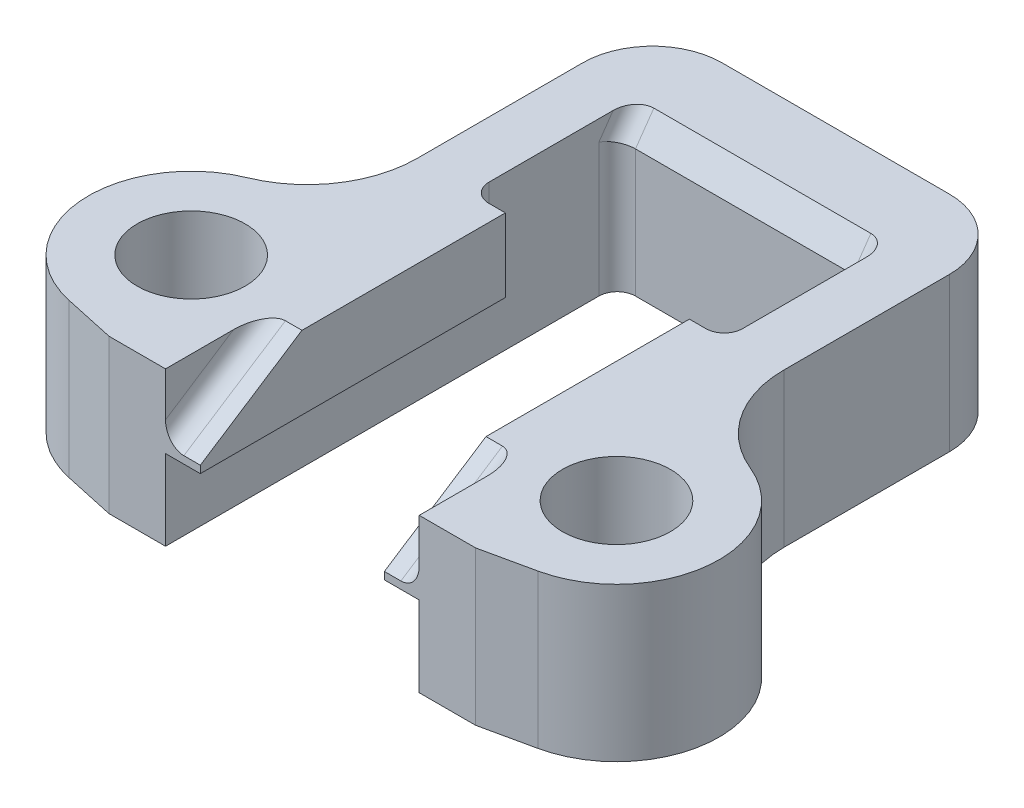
ISO-10303-21;
HEADER;
FILE_DESCRIPTION(('STEP AP214'),'2;1');
FILE_NAME('part.step','',(''),(''),'','','');
FILE_SCHEMA(('AUTOMOTIVE_DESIGN { 1 0 10303 214 1 1 1 1 }'));
ENDSEC;
DATA;
#1=APPLICATION_CONTEXT('core data for automotive mechanical design processes');
#2=APPLICATION_PROTOCOL_DEFINITION('international standard','automotive_design',2000,#1);
#3=PRODUCT_CONTEXT('',#1,'mechanical');
#4=PRODUCT('Part','Part','',(#3));
#5=PRODUCT_RELATED_PRODUCT_CATEGORY('part','',(#4));
#6=PRODUCT_DEFINITION_FORMATION('','',#4);
#7=PRODUCT_DEFINITION_CONTEXT('part definition',#1,'design');
#8=PRODUCT_DEFINITION('design','',#6,#7);
#9=PRODUCT_DEFINITION_SHAPE('','',#8);
#10=(LENGTH_UNIT() NAMED_UNIT(*) SI_UNIT(.MILLI.,.METRE.));
#11=(NAMED_UNIT(*) PLANE_ANGLE_UNIT() SI_UNIT($,.RADIAN.));
#12=(NAMED_UNIT(*) SI_UNIT($,.STERADIAN.) SOLID_ANGLE_UNIT());
#13=UNCERTAINTY_MEASURE_WITH_UNIT(LENGTH_MEASURE(1.E-05),#10,'distance_accuracy_value','');
#14=(GEOMETRIC_REPRESENTATION_CONTEXT(3) GLOBAL_UNCERTAINTY_ASSIGNED_CONTEXT((#13)) GLOBAL_UNIT_ASSIGNED_CONTEXT((#10,
#11,#12)) REPRESENTATION_CONTEXT('',''));
#15=CARTESIAN_POINT('',(0.,0.,0.));
#16=DIRECTION('',(0.,0.,1.));
#17=DIRECTION('',(1.,0.,0.));
#18=AXIS2_PLACEMENT_3D('',#15,#16,#17);
#19=CARTESIAN_POINT('',(-38.74,-7.13469398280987,0.960000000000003));
#20=DIRECTION('',(-1.,0.,0.));
#21=DIRECTION('',(0.,0.,1.));
#22=AXIS2_PLACEMENT_3D('',#19,#20,#21);
#23=PLANE('',#22);
#24=DIRECTION('',(0.,0.,1.));
#25=VECTOR('',#24,1.);
#26=CARTESIAN_POINT('',(-38.74,14.391,0.960000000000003));
#27=LINE('',#26,#25);
#28=CARTESIAN_POINT('',(-38.74,14.391,-11.2496127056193));
#29=VERTEX_POINT('',#28);
#30=CARTESIAN_POINT('',(-38.74,14.391,-7.86));
#31=VERTEX_POINT('',#30);
#32=EDGE_CURVE('E452',#29,#31,#27,.T.);
#33=ORIENTED_EDGE('',*,*,#32,.F.);
#34=DIRECTION('',(0.,-0.819152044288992,0.573576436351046));
#35=VECTOR('',#34,1.);
#36=CARTESIAN_POINT('',(-38.74,13.9637142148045,-10.9504239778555));
#37=LINE('',#36,#35);
#38=CARTESIAN_POINT('',(-38.74,13.8345753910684,-10.86));
#39=VERTEX_POINT('',#38);
#40=EDGE_CURVE('E511',#29,#39,#37,.T.);
#41=ORIENTED_EDGE('',*,*,#40,.T.);
#42=DIRECTION('',(0.,1.,0.));
#43=VECTOR('',#42,1.);
#44=CARTESIAN_POINT('',(-38.74,10.2,-10.86));
#45=LINE('',#44,#43);
#46=CARTESIAN_POINT('',(-38.74,10.2,-10.86));
#47=VERTEX_POINT('',#46);
#48=EDGE_CURVE('E509',#39,#47,#45,.F.);
#49=ORIENTED_EDGE('',*,*,#48,.T.);
#50=DIRECTION('',(0.,0.,-1.));
#51=VECTOR('',#50,1.);
#52=CARTESIAN_POINT('',(-38.74,10.2,0.960000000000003));
#53=LINE('',#52,#51);
#54=CARTESIAN_POINT('',(-38.74,10.2,0.960000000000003));
#55=VERTEX_POINT('',#54);
#56=EDGE_CURVE('E465',#55,#47,#53,.T.);
#57=ORIENTED_EDGE('',*,*,#56,.F.);
#58=DIRECTION('',(0.,1.,0.));
#59=VECTOR('',#58,1.);
#60=CARTESIAN_POINT('',(-38.74,-7.13469398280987,0.960000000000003));
#61=LINE('',#60,#59);
#62=CARTESIAN_POINT('',(-38.74,12.391,0.960000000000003));
#63=VERTEX_POINT('',#62);
#64=EDGE_CURVE('E458',#55,#63,#61,.T.);
#65=ORIENTED_EDGE('',*,*,#64,.T.);
#66=DIRECTION('',(0.,0.,1.));
#67=VECTOR('',#66,1.);
#68=CARTESIAN_POINT('',(-38.74,12.391,-7.36));
#69=LINE('',#68,#67);
#70=CARTESIAN_POINT('',(-38.74,12.391,-7.86));
#71=VERTEX_POINT('',#70);
#72=EDGE_CURVE('E410',#71,#63,#69,.T.);
#73=ORIENTED_EDGE('',*,*,#72,.F.);
#74=DIRECTION('',(0.,-1.,0.));
#75=VECTOR('',#74,1.);
#76=CARTESIAN_POINT('',(-38.74,-7.13469398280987,-7.86));
#77=LINE('',#76,#75);
#78=EDGE_CURVE('E507',#71,#31,#77,.F.);
#79=ORIENTED_EDGE('',*,*,#78,.T.);
#80=EDGE_LOOP('',(#33,#41,#49,#57,#65,#73,#79));
#81=FACE_BOUND('',#80,.T.);
#82=ADVANCED_FACE('F38',(#81),#23,.T.);
#83=CARTESIAN_POINT('',(-38.74,14.391,-0.893717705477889));
#84=VERTEX_POINT('',#83);
#85=CARTESIAN_POINT('',(-38.74,14.391,0.960000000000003));
#86=VERTEX_POINT('',#85);
#87=EDGE_CURVE('E451',#84,#86,#27,.T.);
#88=ORIENTED_EDGE('',*,*,#87,.F.);
#89=DIRECTION('',(0.,0.544639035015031,-0.838670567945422));
#90=VECTOR('',#89,1.);
#91=CARTESIAN_POINT('',(-38.74,7.159069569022,10.2424785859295));
#92=LINE('',#91,#90);
#93=CARTESIAN_POINT('',(-38.74,13.187181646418,0.960000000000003));
#94=VERTEX_POINT('',#93);
#95=EDGE_CURVE('E505',#84,#94,#92,.F.);
#96=ORIENTED_EDGE('',*,*,#95,.T.);
#97=EDGE_CURVE('E473',#94,#86,#61,.T.);
#98=ORIENTED_EDGE('',*,*,#97,.T.);
#99=EDGE_LOOP('',(#88,#96,#98));
#100=FACE_BOUND('',#99,.T.);
#101=ADVANCED_FACE('F648',(#100),#23,.T.);
#102=CARTESIAN_POINT('',(-37.2,-7.13469398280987,0.960000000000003));
#103=DIRECTION('',(0.,0.,1.));
#104=DIRECTION('',(1.,0.,0.));
#105=AXIS2_PLACEMENT_3D('',#102,#103,#104);
#106=PLANE('',#105);
#107=DIRECTION('',(-1.,0.,0.));
#108=VECTOR('',#107,1.);
#109=CARTESIAN_POINT('',(-37.2,10.2,0.960000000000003));
#110=LINE('',#109,#108);
#111=CARTESIAN_POINT('',(-37.2,10.2,0.960000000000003));
#112=VERTEX_POINT('',#111);
#113=EDGE_CURVE('E468',#112,#55,#110,.T.);
#114=ORIENTED_EDGE('',*,*,#113,.F.);
#115=DIRECTION('',(0.,1.,0.));
#116=VECTOR('',#115,1.);
#117=CARTESIAN_POINT('',(-37.2,-7.13469398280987,0.960000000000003));
#118=LINE('',#117,#116);
#119=CARTESIAN_POINT('',(-37.2,14.391,0.960000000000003));
#120=VERTEX_POINT('',#119);
#121=EDGE_CURVE('E454',#112,#120,#118,.T.);
#122=ORIENTED_EDGE('',*,*,#121,.T.);
#123=DIRECTION('',(1.,0.,0.));
#124=VECTOR('',#123,1.);
#125=CARTESIAN_POINT('',(-37.2,14.391,0.960000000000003));
#126=LINE('',#125,#124);
#127=EDGE_CURVE('E437',#86,#120,#126,.T.);
#128=ORIENTED_EDGE('',*,*,#127,.F.);
#129=ORIENTED_EDGE('',*,*,#97,.F.);
#130=CARTESIAN_POINT('',(-39.24,13.187181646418,0.960000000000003));
#131=DIRECTION('',(0.,0.,1.));
#132=DIRECTION('',(0.,1.,0.));
#133=AXIS2_PLACEMENT_3D('',#130,#131,#132);
#134=ELLIPSE('',#133,0.596181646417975,0.5);
#135=CARTESIAN_POINT('',(-39.24,12.591,0.960000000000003));
#136=VERTEX_POINT('',#135);
#137=EDGE_CURVE('E522',#94,#136,#134,.F.);
#138=ORIENTED_EDGE('',*,*,#137,.T.);
#139=DIRECTION('',(1.,0.,0.));
#140=VECTOR('',#139,1.);
#141=CARTESIAN_POINT('',(-39.69,12.591,0.960000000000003));
#142=LINE('',#141,#140);
#143=CARTESIAN_POINT('',(-39.69,12.591,0.960000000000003));
#144=VERTEX_POINT('',#143);
#145=EDGE_CURVE('E428',#144,#136,#142,.T.);
#146=ORIENTED_EDGE('',*,*,#145,.F.);
#147=DIRECTION('',(0.,1.,0.));
#148=VECTOR('',#147,1.);
#149=CARTESIAN_POINT('',(-39.69,12.591,0.960000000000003));
#150=LINE('',#149,#148);
#151=CARTESIAN_POINT('',(-39.69,12.391,0.960000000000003));
#152=VERTEX_POINT('',#151);
#153=EDGE_CURVE('E416',#152,#144,#150,.T.);
#154=ORIENTED_EDGE('',*,*,#153,.F.);
#155=DIRECTION('',(1.,0.,0.));
#156=VECTOR('',#155,1.);
#157=CARTESIAN_POINT('',(-39.69,12.391,0.960000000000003));
#158=LINE('',#157,#156);
#159=EDGE_CURVE('E431',#152,#63,#158,.T.);
#160=ORIENTED_EDGE('',*,*,#159,.T.);
#161=ORIENTED_EDGE('',*,*,#64,.F.);
#162=EDGE_LOOP('',(#114,#122,#128,#129,#138,#146,#154,#160,#161));
#163=FACE_BOUND('',#162,.T.);
#164=ADVANCED_FACE('F625',(#163),#106,.T.);
#165=CARTESIAN_POINT('',(-38.74,-7.13469398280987,-11.36));
#166=DIRECTION('',(0.,0.,1.));
#167=DIRECTION('',(1.,0.,0.));
#168=AXIS2_PLACEMENT_3D('',#165,#166,#167);
#169=PLANE('',#168);
#170=DIRECTION('',(-1.,0.,0.));
#171=VECTOR('',#170,1.);
#172=CARTESIAN_POINT('',(-38.74,10.2,-11.36));
#173=LINE('',#172,#171);
#174=CARTESIAN_POINT('',(-39.24,10.2,-11.36));
#175=VERTEX_POINT('',#174);
#176=CARTESIAN_POINT('',(-45.16,10.2,-11.36));
#177=VERTEX_POINT('',#176);
#178=EDGE_CURVE('E463',#175,#177,#173,.T.);
#179=ORIENTED_EDGE('',*,*,#178,.F.);
#180=DIRECTION('',(0.,1.,0.));
#181=VECTOR('',#180,1.);
#182=CARTESIAN_POINT('',(-39.24,13.6769259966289,-11.36));
#183=LINE('',#182,#181);
#184=CARTESIAN_POINT('',(-39.24,13.6769259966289,-11.36));
#185=VERTEX_POINT('',#184);
#186=EDGE_CURVE('E516',#175,#185,#183,.T.);
#187=ORIENTED_EDGE('',*,*,#186,.T.);
#188=DIRECTION('',(-1.,0.,0.));
#189=VECTOR('',#188,1.);
#190=CARTESIAN_POINT('',(-42.2,13.6769259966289,-11.36));
#191=LINE('',#190,#189);
#192=CARTESIAN_POINT('',(-45.16,13.6769259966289,-11.36));
#193=VERTEX_POINT('',#192);
#194=EDGE_CURVE('E481',#185,#193,#191,.T.);
#195=ORIENTED_EDGE('',*,*,#194,.T.);
#196=DIRECTION('',(0.,1.,0.));
#197=VECTOR('',#196,1.);
#198=CARTESIAN_POINT('',(-45.16,13.6769259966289,-11.36));
#199=LINE('',#198,#197);
#200=EDGE_CURVE('E382',#177,#193,#199,.T.);
#201=ORIENTED_EDGE('',*,*,#200,.F.);
#202=EDGE_LOOP('',(#179,#187,#195,#201));
#203=FACE_BOUND('',#202,.T.);
#204=ADVANCED_FACE('F557',(#203),#169,.T.);
#205=CARTESIAN_POINT('',(-42.2,-7.13469398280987,-13.86));
#206=DIRECTION('',(0.,0.,-1.));
#207=DIRECTION('',(-1.,0.,0.));
#208=AXIS2_PLACEMENT_3D('',#205,#206,#207);
#209=PLANE('',#208);
#210=DIRECTION('',(-1.,0.,0.));
#211=VECTOR('',#210,1.);
#212=CARTESIAN_POINT('',(-42.2,14.391,-13.86));
#213=LINE('',#212,#211);
#214=CARTESIAN_POINT('',(-39.1,14.391,-13.86));
#215=VERTEX_POINT('',#214);
#216=CARTESIAN_POINT('',(-45.3,14.391,-13.86));
#217=VERTEX_POINT('',#216);
#218=EDGE_CURVE('E449',#215,#217,#213,.T.);
#219=ORIENTED_EDGE('',*,*,#218,.F.);
#220=DIRECTION('',(0.,1.,0.));
#221=VECTOR('',#220,1.);
#222=CARTESIAN_POINT('',(-39.1,-7.13469398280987,-13.86));
#223=LINE('',#222,#221);
#224=CARTESIAN_POINT('',(-39.1,10.2,-13.86));
#225=VERTEX_POINT('',#224);
#226=EDGE_CURVE('E498',#215,#225,#223,.F.);
#227=ORIENTED_EDGE('',*,*,#226,.T.);
#228=DIRECTION('',(1.,0.,0.));
#229=VECTOR('',#228,1.);
#230=CARTESIAN_POINT('',(-42.2,10.2,-13.86));
#231=LINE('',#230,#229);
#232=CARTESIAN_POINT('',(-45.3,10.2,-13.86));
#233=VERTEX_POINT('',#232);
#234=EDGE_CURVE('E460',#233,#225,#231,.T.);
#235=ORIENTED_EDGE('',*,*,#234,.F.);
#236=DIRECTION('',(0.,1.,0.));
#237=VECTOR('',#236,1.);
#238=CARTESIAN_POINT('',(-45.3,-7.13469398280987,-13.86));
#239=LINE('',#238,#237);
#240=EDGE_CURVE('E360',#217,#233,#239,.F.);
#241=ORIENTED_EDGE('',*,*,#240,.F.);
#242=EDGE_LOOP('',(#219,#227,#235,#241));
#243=FACE_BOUND('',#242,.T.);
#244=ADVANCED_FACE('F600',(#243),#209,.T.);
#245=CARTESIAN_POINT('',(-37.2,-7.13469398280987,-13.86));
#246=DIRECTION('',(1.,0.,0.));
#247=DIRECTION('',(0.,0.,-1.));
#248=AXIS2_PLACEMENT_3D('',#245,#246,#247);
#249=PLANE('',#248);
#250=DIRECTION('',(0.,0.,1.));
#251=VECTOR('',#250,1.);
#252=CARTESIAN_POINT('',(-37.2,10.2,-13.86));
#253=LINE('',#252,#251);
#254=CARTESIAN_POINT('',(-37.2,10.2,-11.96));
#255=VERTEX_POINT('',#254);
#256=CARTESIAN_POINT('',(-37.2,10.2,-7.44669035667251));
#257=VERTEX_POINT('',#256);
#258=EDGE_CURVE('E457',#255,#257,#253,.T.);
#259=ORIENTED_EDGE('',*,*,#258,.F.);
#260=DIRECTION('',(0.,1.,0.));
#261=VECTOR('',#260,1.);
#262=CARTESIAN_POINT('',(-37.2,-7.13469398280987,-11.96));
#263=LINE('',#262,#261);
#264=CARTESIAN_POINT('',(-37.2,14.391,-11.96));
#265=VERTEX_POINT('',#264);
#266=EDGE_CURVE('E493',#255,#265,#263,.T.);
#267=ORIENTED_EDGE('',*,*,#266,.T.);
#268=DIRECTION('',(0.,0.,-1.));
#269=VECTOR('',#268,1.);
#270=CARTESIAN_POINT('',(-37.2,14.391,-13.86));
#271=LINE('',#270,#269);
#272=CARTESIAN_POINT('',(-37.2,14.391,-7.44669035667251));
#273=VERTEX_POINT('',#272);
#274=EDGE_CURVE('E446',#273,#265,#271,.T.);
#275=ORIENTED_EDGE('',*,*,#274,.F.);
#276=DIRECTION('',(0.,-1.,0.));
#277=VECTOR('',#276,1.);
#278=CARTESIAN_POINT('',(-37.2,10.2,-7.44669035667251));
#279=LINE('',#278,#277);
#280=EDGE_CURVE('E486',#273,#257,#279,.T.);
#281=ORIENTED_EDGE('',*,*,#280,.T.);
#282=EDGE_LOOP('',(#259,#267,#275,#281));
#283=FACE_BOUND('',#282,.T.);
#284=ADVANCED_FACE('F607',(#283),#249,.T.);
#285=CARTESIAN_POINT('',(-36.3996896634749,-7.13469398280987,-2.08));
#286=DIRECTION('',(0.,1.,0.));
#287=DIRECTION('',(0.,0.,1.));
#288=AXIS2_PLACEMENT_3D('',#285,#286,#287);
#289=CYLINDRICAL_SURFACE('',#288,2.8);
#290=CARTESIAN_POINT('',(-36.3996896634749,10.2,-2.08));
#291=DIRECTION('',(0.,1.,0.));
#292=DIRECTION('',(0.,0.,1.));
#293=AXIS2_PLACEMENT_3D('',#290,#291,#292);
#294=CIRCLE('',#293,2.8);
#295=CARTESIAN_POINT('',(-35.3377705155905,10.2,-4.67081603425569));
#296=VERTEX_POINT('',#295);
#297=CARTESIAN_POINT('',(-35.8037249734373,10.2,0.655841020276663));
#298=VERTEX_POINT('',#297);
#299=EDGE_CURVE('E455',#296,#298,#294,.F.);
#300=ORIENTED_EDGE('',*,*,#299,.F.);
#301=DIRECTION('',(0.,1.,0.));
#302=VECTOR('',#301,1.);
#303=CARTESIAN_POINT('',(-35.3377705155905,-7.13469398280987,-4.67081603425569));
#304=LINE('',#303,#302);
#305=CARTESIAN_POINT('',(-35.3377705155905,14.391,-4.67081603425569));
#306=VERTEX_POINT('',#305);
#307=EDGE_CURVE('E483',#296,#306,#304,.T.);
#308=ORIENTED_EDGE('',*,*,#307,.T.);
#309=CARTESIAN_POINT('',(-36.3996896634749,14.391,-2.08));
#310=DIRECTION('',(0.,1.,0.));
#311=DIRECTION('',(0.,0.,-1.));
#312=AXIS2_PLACEMENT_3D('',#309,#310,#311);
#313=CIRCLE('',#312,2.8);
#314=CARTESIAN_POINT('',(-35.8037249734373,14.391,0.655841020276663));
#315=VERTEX_POINT('',#314);
#316=EDGE_CURVE('E443',#315,#306,#313,.T.);
#317=ORIENTED_EDGE('',*,*,#316,.F.);
#318=DIRECTION('',(0.,1.,0.));
#319=VECTOR('',#318,1.);
#320=CARTESIAN_POINT('',(-35.8037249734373,-7.13469398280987,0.655841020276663));
#321=LINE('',#320,#319);
#322=EDGE_CURVE('E474',#298,#315,#321,.T.);
#323=ORIENTED_EDGE('',*,*,#322,.F.);
#324=EDGE_LOOP('',(#300,#308,#317,#323));
#325=FACE_BOUND('',#324,.T.);
#326=ADVANCED_FACE('F617',(#325),#289,.T.);
#327=CARTESIAN_POINT('',(-37.2,-7.13469398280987,0.960000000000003));
#328=DIRECTION('',(0.212844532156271,0.,0.977086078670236));
#329=DIRECTION('',(0.977086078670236,0.,-0.212844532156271));
#330=AXIS2_PLACEMENT_3D('',#327,#328,#329);
#331=PLANE('',#330);
#332=DIRECTION('',(-0.977086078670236,0.,0.212844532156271));
#333=VECTOR('',#332,1.);
#334=CARTESIAN_POINT('',(-37.2,10.2,0.960000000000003));
#335=LINE('',#334,#333);
#336=EDGE_CURVE('E470',#298,#112,#335,.T.);
#337=ORIENTED_EDGE('',*,*,#336,.F.);
#338=ORIENTED_EDGE('',*,*,#322,.T.);
#339=DIRECTION('',(0.977086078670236,0.,-0.212844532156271));
#340=VECTOR('',#339,1.);
#341=CARTESIAN_POINT('',(-37.2,14.391,0.960000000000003));
#342=LINE('',#341,#340);
#343=EDGE_CURVE('E440',#120,#315,#342,.T.);
#344=ORIENTED_EDGE('',*,*,#343,.F.);
#345=ORIENTED_EDGE('',*,*,#121,.F.);
#346=EDGE_LOOP('',(#337,#338,#344,#345));
#347=FACE_BOUND('',#346,.T.);
#348=ADVANCED_FACE('F623',(#347),#331,.T.);
#349=CARTESIAN_POINT('',(0.,10.2,0.));
#350=DIRECTION('',(0.,1.,0.));
#351=DIRECTION('',(0.,0.,1.));
#352=AXIS2_PLACEMENT_3D('',#349,#350,#351);
#353=PLANE('',#352);
#354=CARTESIAN_POINT('',(-36.3996896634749,10.2,-2.08));
#355=DIRECTION('',(0.,1.,0.));
#356=DIRECTION('',(0.,0.,1.));
#357=AXIS2_PLACEMENT_3D('',#354,#355,#356);
#358=CIRCLE('',#357,1.4732);
#359=CARTESIAN_POINT('',(-36.3996896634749,10.2,-0.606799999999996));
#360=VERTEX_POINT('',#359);
#361=EDGE_CURVE('E407',#360,#360,#358,.T.);
#362=ORIENTED_EDGE('',*,*,#361,.T.);
#363=EDGE_LOOP('',(#362));
#364=FACE_BOUND('',#363,.T.);
#365=ORIENTED_EDGE('',*,*,#234,.T.);
#366=CARTESIAN_POINT('',(-39.1,10.2,-11.96));
#367=DIRECTION('',(0.,1.,0.));
#368=DIRECTION('',(0.,0.,1.));
#369=AXIS2_PLACEMENT_3D('',#366,#367,#368);
#370=CIRCLE('',#369,1.9);
#371=EDGE_CURVE('E500',#225,#255,#370,.F.);
#372=ORIENTED_EDGE('',*,*,#371,.T.);
#373=ORIENTED_EDGE('',*,*,#258,.T.);
#374=CARTESIAN_POINT('',(-34.2,10.2,-7.44669035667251));
#375=DIRECTION('',(0.,1.,0.));
#376=DIRECTION('',(0.,0.,1.));
#377=AXIS2_PLACEMENT_3D('',#374,#375,#376);
#378=CIRCLE('',#377,3.);
#379=EDGE_CURVE('E491',#257,#296,#378,.T.);
#380=ORIENTED_EDGE('',*,*,#379,.T.);
#381=ORIENTED_EDGE('',*,*,#299,.T.);
#382=ORIENTED_EDGE('',*,*,#336,.T.);
#383=ORIENTED_EDGE('',*,*,#113,.T.);
#384=ORIENTED_EDGE('',*,*,#56,.T.);
#385=CARTESIAN_POINT('',(-39.24,10.2,-10.86));
#386=DIRECTION('',(0.,1.,0.));
#387=DIRECTION('',(0.,0.,1.));
#388=AXIS2_PLACEMENT_3D('',#385,#386,#387);
#389=CIRCLE('',#388,0.5);
#390=EDGE_CURVE('E526',#47,#175,#389,.T.);
#391=ORIENTED_EDGE('',*,*,#390,.T.);
#392=ORIENTED_EDGE('',*,*,#178,.T.);
#393=CARTESIAN_POINT('',(-45.16,10.2,-10.86));
#394=DIRECTION('',(0.,-1.,0.));
#395=DIRECTION('',(0.,0.,1.));
#396=AXIS2_PLACEMENT_3D('',#393,#394,#395);
#397=CIRCLE('',#396,0.5);
#398=CARTESIAN_POINT('',(-45.66,10.2,-10.86));
#399=VERTEX_POINT('',#398);
#400=EDGE_CURVE('E394',#399,#177,#397,.T.);
#401=ORIENTED_EDGE('',*,*,#400,.F.);
#402=DIRECTION('',(0.,0.,-1.));
#403=VECTOR('',#402,1.);
#404=CARTESIAN_POINT('',(-45.66,10.2,0.960000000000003));
#405=LINE('',#404,#403);
#406=CARTESIAN_POINT('',(-45.66,10.2,0.960000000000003));
#407=VERTEX_POINT('',#406);
#408=EDGE_CURVE('E329',#407,#399,#405,.T.);
#409=ORIENTED_EDGE('',*,*,#408,.F.);
#410=DIRECTION('',(1.,0.,0.));
#411=VECTOR('',#410,1.);
#412=CARTESIAN_POINT('',(-47.2,10.2,0.960000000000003));
#413=LINE('',#412,#411);
#414=CARTESIAN_POINT('',(-47.2,10.2,0.960000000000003));
#415=VERTEX_POINT('',#414);
#416=EDGE_CURVE('E332',#415,#407,#413,.T.);
#417=ORIENTED_EDGE('',*,*,#416,.F.);
#418=DIRECTION('',(0.977086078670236,0.,0.212844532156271));
#419=VECTOR('',#418,1.);
#420=CARTESIAN_POINT('',(-47.2,10.2,0.960000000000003));
#421=LINE('',#420,#419);
#422=CARTESIAN_POINT('',(-48.5962750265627,10.2,0.655841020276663));
#423=VERTEX_POINT('',#422);
#424=EDGE_CURVE('E334',#423,#415,#421,.T.);
#425=ORIENTED_EDGE('',*,*,#424,.F.);
#426=CARTESIAN_POINT('',(-48.0003103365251,10.2,-2.08));
#427=DIRECTION('',(0.,-1.,0.));
#428=DIRECTION('',(0.,0.,1.));
#429=AXIS2_PLACEMENT_3D('',#426,#427,#428);
#430=CIRCLE('',#429,2.8);
#431=CARTESIAN_POINT('',(-49.0622294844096,10.2,-4.67081603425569));
#432=VERTEX_POINT('',#431);
#433=EDGE_CURVE('E322',#432,#423,#430,.F.);
#434=ORIENTED_EDGE('',*,*,#433,.F.);
#435=CARTESIAN_POINT('',(-50.2,10.2,-7.44669035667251));
#436=DIRECTION('',(0.,-1.,0.));
#437=DIRECTION('',(0.,0.,1.));
#438=AXIS2_PLACEMENT_3D('',#435,#436,#437);
#439=CIRCLE('',#438,3.);
#440=CARTESIAN_POINT('',(-47.2,10.2,-7.44669035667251));
#441=VERTEX_POINT('',#440);
#442=EDGE_CURVE('E352',#441,#432,#439,.T.);
#443=ORIENTED_EDGE('',*,*,#442,.F.);
#444=DIRECTION('',(0.,0.,1.));
#445=VECTOR('',#444,1.);
#446=CARTESIAN_POINT('',(-47.2,10.2,-13.86));
#447=LINE('',#446,#445);
#448=CARTESIAN_POINT('',(-47.2,10.2,-11.96));
#449=VERTEX_POINT('',#448);
#450=EDGE_CURVE('E325',#449,#441,#447,.T.);
#451=ORIENTED_EDGE('',*,*,#450,.F.);
#452=CARTESIAN_POINT('',(-45.3,10.2,-11.96));
#453=DIRECTION('',(0.,-1.,0.));
#454=DIRECTION('',(0.,0.,1.));
#455=AXIS2_PLACEMENT_3D('',#452,#453,#454);
#456=CIRCLE('',#455,1.9);
#457=EDGE_CURVE('E363',#233,#449,#456,.F.);
#458=ORIENTED_EDGE('',*,*,#457,.F.);
#459=EDGE_LOOP('',(#365,#372,#373,#380,#381,#382,#383,#384,#391,#392,#401,#409,#417,#425,#434,
#443,#451,#458));
#460=FACE_BOUND('',#459,.T.);
#461=CARTESIAN_POINT('',(-48.0003103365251,10.2,-2.08));
#462=DIRECTION('',(0.,-1.,0.));
#463=DIRECTION('',(0.,0.,1.));
#464=AXIS2_PLACEMENT_3D('',#461,#462,#463);
#465=CIRCLE('',#464,1.4732);
#466=CARTESIAN_POINT('',(-48.0003103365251,10.2,-0.606799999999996));
#467=VERTEX_POINT('',#466);
#468=EDGE_CURVE('E289',#467,#467,#465,.T.);
#469=ORIENTED_EDGE('',*,*,#468,.F.);
#470=EDGE_LOOP('',(#469));
#471=FACE_BOUND('',#470,.T.);
#472=ADVANCED_FACE('F549',(#364,#460,#471),#353,.F.);
#473=CARTESIAN_POINT('',(-36.3996896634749,14.391,-2.08));
#474=DIRECTION('',(0.,-1.,0.));
#475=DIRECTION('',(0.,0.,-1.));
#476=AXIS2_PLACEMENT_3D('',#473,#474,#475);
#477=PLANE('',#476);
#478=CARTESIAN_POINT('',(-36.3996896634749,14.391,-2.08));
#479=DIRECTION('',(0.,1.,0.));
#480=DIRECTION('',(0.,0.,1.));
#481=AXIS2_PLACEMENT_3D('',#478,#479,#480);
#482=CIRCLE('',#481,1.4732);
#483=CARTESIAN_POINT('',(-36.3996896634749,14.391,-0.606799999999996));
#484=VERTEX_POINT('',#483);
#485=EDGE_CURVE('E404',#484,#484,#482,.T.);
#486=ORIENTED_EDGE('',*,*,#485,.F.);
#487=EDGE_LOOP('',(#486));
#488=FACE_BOUND('',#487,.T.);
#489=ORIENTED_EDGE('',*,*,#274,.T.);
#490=CARTESIAN_POINT('',(-39.1,14.391,-11.96));
#491=DIRECTION('',(0.,-1.,0.));
#492=DIRECTION('',(0.,0.,-1.));
#493=AXIS2_PLACEMENT_3D('',#490,#491,#492);
#494=CIRCLE('',#493,1.9);
#495=EDGE_CURVE('E496',#265,#215,#494,.F.);
#496=ORIENTED_EDGE('',*,*,#495,.T.);
#497=ORIENTED_EDGE('',*,*,#218,.T.);
#498=CARTESIAN_POINT('',(-45.3,14.391,-11.96));
#499=DIRECTION('',(0.,1.,0.));
#500=DIRECTION('',(0.,0.,-1.));
#501=AXIS2_PLACEMENT_3D('',#498,#499,#500);
#502=CIRCLE('',#501,1.9);
#503=CARTESIAN_POINT('',(-47.2,14.391,-11.96));
#504=VERTEX_POINT('',#503);
#505=EDGE_CURVE('E357',#504,#217,#502,.F.);
#506=ORIENTED_EDGE('',*,*,#505,.F.);
#507=DIRECTION('',(0.,0.,-1.));
#508=VECTOR('',#507,1.);
#509=CARTESIAN_POINT('',(-47.2,14.391,-13.86));
#510=LINE('',#509,#508);
#511=CARTESIAN_POINT('',(-47.2,14.391,-7.44669035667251));
#512=VERTEX_POINT('',#511);
#513=EDGE_CURVE('E314',#512,#504,#510,.T.);
#514=ORIENTED_EDGE('',*,*,#513,.F.);
#515=CARTESIAN_POINT('',(-50.2,14.391,-7.44669035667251));
#516=DIRECTION('',(0.,1.,0.));
#517=DIRECTION('',(0.,0.,-1.));
#518=AXIS2_PLACEMENT_3D('',#515,#516,#517);
#519=CIRCLE('',#518,3.);
#520=CARTESIAN_POINT('',(-49.0622294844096,14.391,-4.67081603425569));
#521=VERTEX_POINT('',#520);
#522=EDGE_CURVE('E350',#521,#512,#519,.T.);
#523=ORIENTED_EDGE('',*,*,#522,.F.);
#524=CARTESIAN_POINT('',(-48.0003103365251,14.391,-2.08));
#525=DIRECTION('',(0.,-1.,0.));
#526=DIRECTION('',(0.,0.,-1.));
#527=AXIS2_PLACEMENT_3D('',#524,#525,#526);
#528=CIRCLE('',#527,2.8);
#529=CARTESIAN_POINT('',(-48.5962750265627,14.391,0.655841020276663));
#530=VERTEX_POINT('',#529);
#531=EDGE_CURVE('E311',#530,#521,#528,.T.);
#532=ORIENTED_EDGE('',*,*,#531,.F.);
#533=DIRECTION('',(-0.977086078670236,0.,-0.212844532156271));
#534=VECTOR('',#533,1.);
#535=CARTESIAN_POINT('',(-47.2,14.391,0.960000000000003));
#536=LINE('',#535,#534);
#537=CARTESIAN_POINT('',(-47.2,14.391,0.960000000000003));
#538=VERTEX_POINT('',#537);
#539=EDGE_CURVE('E309',#538,#530,#536,.T.);
#540=ORIENTED_EDGE('',*,*,#539,.F.);
#541=DIRECTION('',(-1.,0.,0.));
#542=VECTOR('',#541,1.);
#543=CARTESIAN_POINT('',(-47.2,14.391,0.960000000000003));
#544=LINE('',#543,#542);
#545=CARTESIAN_POINT('',(-45.66,14.391,0.960000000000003));
#546=VERTEX_POINT('',#545);
#547=EDGE_CURVE('E279',#546,#538,#544,.T.);
#548=ORIENTED_EDGE('',*,*,#547,.F.);
#549=DIRECTION('',(0.,0.,1.));
#550=VECTOR('',#549,1.);
#551=CARTESIAN_POINT('',(-45.66,14.391,0.960000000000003));
#552=LINE('',#551,#550);
#553=CARTESIAN_POINT('',(-45.66,14.391,-0.893717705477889));
#554=VERTEX_POINT('',#553);
#555=EDGE_CURVE('E317',#554,#546,#552,.T.);
#556=ORIENTED_EDGE('',*,*,#555,.F.);
#557=CARTESIAN_POINT('',(-45.16,14.391,-0.893717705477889));
#558=DIRECTION('',(0.,1.,0.));
#559=DIRECTION('',(0.,0.,-1.));
#560=AXIS2_PLACEMENT_3D('',#557,#558,#559);
#561=ELLIPSE('',#560,0.918039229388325,0.5);
#562=CARTESIAN_POINT('',(-45.16,14.391,-1.81175693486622));
#563=VERTEX_POINT('',#562);
#564=EDGE_CURVE('E387',#563,#554,#561,.T.);
#565=ORIENTED_EDGE('',*,*,#564,.F.);
#566=DIRECTION('',(-1.,0.,0.));
#567=VECTOR('',#566,1.);
#568=CARTESIAN_POINT('',(-44.71,14.391,-1.81175693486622));
#569=LINE('',#568,#567);
#570=CARTESIAN_POINT('',(-44.71,14.391,-1.81175693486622));
#571=VERTEX_POINT('',#570);
#572=EDGE_CURVE('E300',#571,#563,#569,.T.);
#573=ORIENTED_EDGE('',*,*,#572,.F.);
#574=DIRECTION('',(0.,0.,-1.));
#575=VECTOR('',#574,1.);
#576=CARTESIAN_POINT('',(-44.71,14.391,-7.36));
#577=LINE('',#576,#575);
#578=CARTESIAN_POINT('',(-44.71,14.391,-7.36));
#579=VERTEX_POINT('',#578);
#580=EDGE_CURVE('E297',#571,#579,#577,.T.);
#581=ORIENTED_EDGE('',*,*,#580,.T.);
#582=DIRECTION('',(-1.,0.,0.));
#583=VECTOR('',#582,1.);
#584=CARTESIAN_POINT('',(-44.71,14.391,-7.36));
#585=LINE('',#584,#583);
#586=CARTESIAN_POINT('',(-45.16,14.391,-7.36));
#587=VERTEX_POINT('',#586);
#588=EDGE_CURVE('E284',#579,#587,#585,.T.);
#589=ORIENTED_EDGE('',*,*,#588,.T.);
#590=CARTESIAN_POINT('',(-45.16,14.391,-7.86));
#591=DIRECTION('',(0.,1.,0.));
#592=DIRECTION('',(0.,0.,-1.));
#593=AXIS2_PLACEMENT_3D('',#590,#591,#592);
#594=CIRCLE('',#593,0.5);
#595=CARTESIAN_POINT('',(-45.66,14.391,-7.86));
#596=VERTEX_POINT('',#595);
#597=EDGE_CURVE('E398',#596,#587,#594,.T.);
#598=ORIENTED_EDGE('',*,*,#597,.F.);
#599=CARTESIAN_POINT('',(-45.66,14.391,-11.2496127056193));
#600=VERTEX_POINT('',#599);
#601=EDGE_CURVE('E318',#600,#596,#552,.T.);
#602=ORIENTED_EDGE('',*,*,#601,.F.);
#603=CARTESIAN_POINT('',(-45.16,14.391,-11.2496127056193));
#604=DIRECTION('',(0.,1.,0.));
#605=DIRECTION('',(0.,0.,-1.));
#606=AXIS2_PLACEMENT_3D('',#603,#604,#605);
#607=ELLIPSE('',#606,0.610387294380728,0.5);
#608=CARTESIAN_POINT('',(-45.16,14.391,-11.86));
#609=VERTEX_POINT('',#608);
#610=EDGE_CURVE('E392',#609,#600,#607,.T.);
#611=ORIENTED_EDGE('',*,*,#610,.F.);
#612=DIRECTION('',(1.,0.,0.));
#613=VECTOR('',#612,1.);
#614=CARTESIAN_POINT('',(-38.74,14.391,-11.86));
#615=LINE('',#614,#613);
#616=CARTESIAN_POINT('',(-39.24,14.391,-11.86));
#617=VERTEX_POINT('',#616);
#618=EDGE_CURVE('E478',#609,#617,#615,.T.);
#619=ORIENTED_EDGE('',*,*,#618,.T.);
#620=CARTESIAN_POINT('',(-39.24,14.391,-11.2496127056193));
#621=DIRECTION('',(0.,-1.,0.));
#622=DIRECTION('',(0.,0.,-1.));
#623=AXIS2_PLACEMENT_3D('',#620,#621,#622);
#624=ELLIPSE('',#623,0.610387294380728,0.5);
#625=EDGE_CURVE('E524',#617,#29,#624,.T.);
#626=ORIENTED_EDGE('',*,*,#625,.T.);
#627=ORIENTED_EDGE('',*,*,#32,.T.);
#628=CARTESIAN_POINT('',(-39.24,14.391,-7.86));
#629=DIRECTION('',(0.,-1.,0.));
#630=DIRECTION('',(0.,0.,-1.));
#631=AXIS2_PLACEMENT_3D('',#628,#629,#630);
#632=CIRCLE('',#631,0.5);
#633=CARTESIAN_POINT('',(-39.24,14.391,-7.36));
#634=VERTEX_POINT('',#633);
#635=EDGE_CURVE('E12',#31,#634,#632,.T.);
#636=ORIENTED_EDGE('',*,*,#635,.T.);
#637=DIRECTION('',(1.,0.,0.));
#638=VECTOR('',#637,1.);
#639=CARTESIAN_POINT('',(-39.69,14.391,-7.36));
#640=LINE('',#639,#638);
#641=CARTESIAN_POINT('',(-39.69,14.391,-7.36));
#642=VERTEX_POINT('',#641);
#643=EDGE_CURVE('E422',#642,#634,#640,.T.);
#644=ORIENTED_EDGE('',*,*,#643,.F.);
#645=DIRECTION('',(0.,0.,-1.));
#646=VECTOR('',#645,1.);
#647=CARTESIAN_POINT('',(-39.69,14.391,-7.36));
#648=LINE('',#647,#646);
#649=CARTESIAN_POINT('',(-39.69,14.391,-1.81175693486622));
#650=VERTEX_POINT('',#649);
#651=EDGE_CURVE('E420',#650,#642,#648,.T.);
#652=ORIENTED_EDGE('',*,*,#651,.F.);
#653=DIRECTION('',(1.,0.,0.));
#654=VECTOR('',#653,1.);
#655=CARTESIAN_POINT('',(-39.69,14.391,-1.81175693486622));
#656=LINE('',#655,#654);
#657=CARTESIAN_POINT('',(-39.24,14.391,-1.81175693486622));
#658=VERTEX_POINT('',#657);
#659=EDGE_CURVE('E425',#650,#658,#656,.T.);
#660=ORIENTED_EDGE('',*,*,#659,.T.);
#661=CARTESIAN_POINT('',(-39.24,14.391,-0.893717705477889));
#662=DIRECTION('',(0.,-1.,0.));
#663=DIRECTION('',(0.,0.,-1.));
#664=AXIS2_PLACEMENT_3D('',#661,#662,#663);
#665=ELLIPSE('',#664,0.918039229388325,0.5);
#666=EDGE_CURVE('E520',#658,#84,#665,.T.);
#667=ORIENTED_EDGE('',*,*,#666,.T.);
#668=ORIENTED_EDGE('',*,*,#87,.T.);
#669=ORIENTED_EDGE('',*,*,#127,.T.);
#670=ORIENTED_EDGE('',*,*,#343,.T.);
#671=ORIENTED_EDGE('',*,*,#316,.T.);
#672=CARTESIAN_POINT('',(-34.2,14.391,-7.44669035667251));
#673=DIRECTION('',(0.,-1.,0.));
#674=DIRECTION('',(0.,0.,-1.));
#675=AXIS2_PLACEMENT_3D('',#672,#673,#674);
#676=CIRCLE('',#675,3.);
#677=EDGE_CURVE('E489',#306,#273,#676,.T.);
#678=ORIENTED_EDGE('',*,*,#677,.T.);
#679=EDGE_LOOP('',(#489,#496,#497,#506,#514,#523,#532,#540,#548,#556,#565,#573,#581,#589,#598,
#602,#611,#619,#626,#627,#636,#644,#652,#660,#667,#668,#669,#670,#671,#678));
#680=FACE_BOUND('',#679,.T.);
#681=CARTESIAN_POINT('',(-48.0003103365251,14.391,-2.08));
#682=DIRECTION('',(0.,-1.,0.));
#683=DIRECTION('',(0.,0.,1.));
#684=AXIS2_PLACEMENT_3D('',#681,#682,#683);
#685=CIRCLE('',#684,1.4732);
#686=CARTESIAN_POINT('',(-48.0003103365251,14.391,-0.606799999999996));
#687=VERTEX_POINT('',#686);
#688=EDGE_CURVE('E403',#687,#687,#685,.T.);
#689=ORIENTED_EDGE('',*,*,#688,.T.);
#690=EDGE_LOOP('',(#689));
#691=FACE_BOUND('',#690,.T.);
#692=ADVANCED_FACE('F535',(#488,#680,#691),#477,.F.);
#693=CARTESIAN_POINT('',(-39.69,12.391,-7.36));
#694=DIRECTION('',(0.,0.,1.));
#695=DIRECTION('',(1.,0.,0.));
#696=AXIS2_PLACEMENT_3D('',#693,#694,#695);
#697=PLANE('',#696);
#698=ORIENTED_EDGE('',*,*,#643,.T.);
#699=DIRECTION('',(0.,-1.,0.));
#700=VECTOR('',#699,1.);
#701=CARTESIAN_POINT('',(-39.24,12.391,-7.36));
#702=LINE('',#701,#700);
#703=CARTESIAN_POINT('',(-39.24,12.391,-7.36));
#704=VERTEX_POINT('',#703);
#705=EDGE_CURVE('E518',#634,#704,#702,.T.);
#706=ORIENTED_EDGE('',*,*,#705,.T.);
#707=DIRECTION('',(1.,0.,0.));
#708=VECTOR('',#707,1.);
#709=CARTESIAN_POINT('',(-39.69,12.391,-7.36));
#710=LINE('',#709,#708);
#711=CARTESIAN_POINT('',(-39.69,12.391,-7.36));
#712=VERTEX_POINT('',#711);
#713=EDGE_CURVE('E434',#712,#704,#710,.T.);
#714=ORIENTED_EDGE('',*,*,#713,.F.);
#715=DIRECTION('',(0.,-1.,0.));
#716=VECTOR('',#715,1.);
#717=CARTESIAN_POINT('',(-39.69,12.391,-7.36));
#718=LINE('',#717,#716);
#719=EDGE_CURVE('E411',#642,#712,#718,.T.);
#720=ORIENTED_EDGE('',*,*,#719,.F.);
#721=EDGE_LOOP('',(#698,#706,#714,#720));
#722=FACE_BOUND('',#721,.T.);
#723=ADVANCED_FACE('F634',(#722),#697,.F.);
#724=CARTESIAN_POINT('',(-39.69,12.391,-7.36));
#725=DIRECTION('',(0.,1.,0.));
#726=DIRECTION('',(0.,0.,1.));
#727=AXIS2_PLACEMENT_3D('',#724,#725,#726);
#728=PLANE('',#727);
#729=ORIENTED_EDGE('',*,*,#72,.T.);
#730=ORIENTED_EDGE('',*,*,#159,.F.);
#731=DIRECTION('',(0.,0.,1.));
#732=VECTOR('',#731,1.);
#733=CARTESIAN_POINT('',(-39.69,12.391,-7.36));
#734=LINE('',#733,#732);
#735=EDGE_CURVE('E414',#712,#152,#734,.T.);
#736=ORIENTED_EDGE('',*,*,#735,.F.);
#737=ORIENTED_EDGE('',*,*,#713,.T.);
#738=CARTESIAN_POINT('',(-39.24,12.391,-7.86));
#739=DIRECTION('',(0.,1.,0.));
#740=DIRECTION('',(0.,0.,1.));
#741=AXIS2_PLACEMENT_3D('',#738,#739,#740);
#742=CIRCLE('',#741,0.5);
#743=EDGE_CURVE('E47',#704,#71,#742,.T.);
#744=ORIENTED_EDGE('',*,*,#743,.T.);
#745=EDGE_LOOP('',(#729,#730,#736,#737,#744));
#746=FACE_BOUND('',#745,.T.);
#747=ADVANCED_FACE('F529',(#746),#728,.F.);
#748=CARTESIAN_POINT('',(-39.69,14.391,-1.81175693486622));
#749=DIRECTION('',(0.,-0.838670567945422,-0.544639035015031));
#750=DIRECTION('',(0.,0.544639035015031,-0.838670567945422));
#751=AXIS2_PLACEMENT_3D('',#748,#749,#750);
#752=PLANE('',#751);
#753=ORIENTED_EDGE('',*,*,#145,.T.);
#754=DIRECTION('',(0.,0.544639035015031,-0.838670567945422));
#755=VECTOR('',#754,1.);
#756=CARTESIAN_POINT('',(-39.24,14.391,-1.81175693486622));
#757=LINE('',#756,#755);
#758=EDGE_CURVE('E502',#136,#658,#757,.T.);
#759=ORIENTED_EDGE('',*,*,#758,.T.);
#760=ORIENTED_EDGE('',*,*,#659,.F.);
#761=DIRECTION('',(0.,0.544639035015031,-0.838670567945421));
#762=VECTOR('',#761,1.);
#763=CARTESIAN_POINT('',(-39.69,14.391,-1.81175693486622));
#764=LINE('',#763,#762);
#765=EDGE_CURVE('E418',#144,#650,#764,.T.);
#766=ORIENTED_EDGE('',*,*,#765,.F.);
#767=EDGE_LOOP('',(#753,#759,#760,#766));
#768=FACE_BOUND('',#767,.T.);
#769=ADVANCED_FACE('F640',(#768),#752,.F.);
#770=CARTESIAN_POINT('',(-39.69,0.,0.));
#771=DIRECTION('',(1.,0.,0.));
#772=DIRECTION('',(0.,0.,-1.));
#773=AXIS2_PLACEMENT_3D('',#770,#771,#772);
#774=PLANE('',#773);
#775=ORIENTED_EDGE('',*,*,#719,.T.);
#776=ORIENTED_EDGE('',*,*,#735,.T.);
#777=ORIENTED_EDGE('',*,*,#153,.T.);
#778=ORIENTED_EDGE('',*,*,#765,.T.);
#779=ORIENTED_EDGE('',*,*,#651,.T.);
#780=EDGE_LOOP('',(#775,#776,#777,#778,#779));
#781=FACE_BOUND('',#780,.T.);
#782=ADVANCED_FACE('F631',(#781),#774,.F.);
#783=CARTESIAN_POINT('',(-36.3996896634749,14.391,-2.08));
#784=DIRECTION('',(0.,1.,0.));
#785=DIRECTION('',(0.,0.,1.));
#786=AXIS2_PLACEMENT_3D('',#783,#784,#785);
#787=CYLINDRICAL_SURFACE('',#786,1.4732);
#788=ORIENTED_EDGE('',*,*,#361,.F.);
#789=EDGE_LOOP('',(#788));
#790=FACE_BOUND('',#789,.T.);
#791=ORIENTED_EDGE('',*,*,#485,.T.);
#792=EDGE_LOOP('',(#791));
#793=FACE_BOUND('',#792,.T.);
#794=ADVANCED_FACE('F693',(#790,#793),#787,.F.);
#795=CARTESIAN_POINT('',(-36.3996896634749,14.391,-11.86));
#796=DIRECTION('',(0.,0.573576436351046,0.819152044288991));
#797=DIRECTION('',(-1.,0.,0.));
#798=AXIS2_PLACEMENT_3D('',#795,#796,#797);
#799=PLANE('',#798);
#800=ORIENTED_EDGE('',*,*,#194,.F.);
#801=DIRECTION('',(0.,-0.819152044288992,0.573576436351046));
#802=VECTOR('',#801,1.);
#803=CARTESIAN_POINT('',(-39.24,14.391,-11.86));
#804=LINE('',#803,#802);
#805=EDGE_CURVE('E514',#185,#617,#804,.F.);
#806=ORIENTED_EDGE('',*,*,#805,.T.);
#807=ORIENTED_EDGE('',*,*,#618,.F.);
#808=DIRECTION('',(0.,-0.819152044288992,0.573576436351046));
#809=VECTOR('',#808,1.);
#810=CARTESIAN_POINT('',(-45.16,14.391,-11.86));
#811=LINE('',#810,#809);
#812=EDGE_CURVE('E379',#193,#609,#811,.F.);
#813=ORIENTED_EDGE('',*,*,#812,.F.);
#814=EDGE_LOOP('',(#800,#806,#807,#813));
#815=FACE_BOUND('',#814,.T.);
#816=ADVANCED_FACE('F562',(#815),#799,.T.);
#817=CARTESIAN_POINT('',(-34.2,-7.13469398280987,-7.44669035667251));
#818=DIRECTION('',(0.,1.,0.));
#819=DIRECTION('',(0.,0.,1.));
#820=AXIS2_PLACEMENT_3D('',#817,#818,#819);
#821=CYLINDRICAL_SURFACE('',#820,3.);
#822=ORIENTED_EDGE('',*,*,#379,.F.);
#823=ORIENTED_EDGE('',*,*,#280,.F.);
#824=ORIENTED_EDGE('',*,*,#677,.F.);
#825=ORIENTED_EDGE('',*,*,#307,.F.);
#826=EDGE_LOOP('',(#822,#823,#824,#825));
#827=FACE_BOUND('',#826,.T.);
#828=ADVANCED_FACE('F613',(#827),#821,.F.);
#829=CARTESIAN_POINT('',(-39.1,-7.13469398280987,-11.96));
#830=DIRECTION('',(0.,1.,0.));
#831=DIRECTION('',(0.,0.,1.));
#832=AXIS2_PLACEMENT_3D('',#829,#830,#831);
#833=CYLINDRICAL_SURFACE('',#832,1.9);
#834=ORIENTED_EDGE('',*,*,#371,.F.);
#835=ORIENTED_EDGE('',*,*,#226,.F.);
#836=ORIENTED_EDGE('',*,*,#495,.F.);
#837=ORIENTED_EDGE('',*,*,#266,.F.);
#838=EDGE_LOOP('',(#834,#835,#836,#837));
#839=FACE_BOUND('',#838,.T.);
#840=ADVANCED_FACE('F603',(#839),#833,.T.);
#841=CARTESIAN_POINT('',(-39.24,14.8103352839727,-1.5394374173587));
#842=DIRECTION('',(0.,0.544639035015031,-0.838670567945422));
#843=DIRECTION('',(0.,0.838670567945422,0.544639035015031));
#844=AXIS2_PLACEMENT_3D('',#841,#842,#843);
#845=CYLINDRICAL_SURFACE('',#844,0.5);
#846=ORIENTED_EDGE('',*,*,#137,.F.);
#847=ORIENTED_EDGE('',*,*,#95,.F.);
#848=ORIENTED_EDGE('',*,*,#666,.F.);
#849=ORIENTED_EDGE('',*,*,#758,.F.);
#850=EDGE_LOOP('',(#846,#847,#848,#849));
#851=FACE_BOUND('',#850,.T.);
#852=ADVANCED_FACE('F644',(#851),#845,.F.);
#853=CARTESIAN_POINT('',(-39.24,-7.13469398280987,-10.86));
#854=DIRECTION('',(0.,-1.,0.));
#855=DIRECTION('',(0.,0.,-1.));
#856=AXIS2_PLACEMENT_3D('',#853,#854,#855);
#857=CYLINDRICAL_SURFACE('',#856,0.5);
#858=ORIENTED_EDGE('',*,*,#390,.F.);
#859=ORIENTED_EDGE('',*,*,#48,.F.);
#860=CARTESIAN_POINT('',(-39.24,13.8345753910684,-10.86));
#861=DIRECTION('',(0.,-0.953716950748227,0.300705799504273));
#862=DIRECTION('',(0.,-0.300705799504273,-0.953716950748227));
#863=AXIS2_PLACEMENT_3D('',#860,#861,#862);
#864=ELLIPSE('',#863,0.524264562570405,0.5);
#865=EDGE_CURVE('E42',#185,#39,#864,.T.);
#866=ORIENTED_EDGE('',*,*,#865,.F.);
#867=ORIENTED_EDGE('',*,*,#186,.F.);
#868=EDGE_LOOP('',(#858,#859,#866,#867));
#869=FACE_BOUND('',#868,.T.);
#870=ADVANCED_FACE('F554',(#869),#857,.F.);
#871=CARTESIAN_POINT('',(-39.24,-5.78959894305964,2.880994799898));
#872=DIRECTION('',(0.,0.819152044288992,-0.573576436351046));
#873=DIRECTION('',(0.,0.573576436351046,0.819152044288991));
#874=AXIS2_PLACEMENT_3D('',#871,#872,#873);
#875=CYLINDRICAL_SURFACE('',#874,0.5);
#876=ORIENTED_EDGE('',*,*,#625,.F.);
#877=ORIENTED_EDGE('',*,*,#805,.F.);
#878=ORIENTED_EDGE('',*,*,#865,.T.);
#879=ORIENTED_EDGE('',*,*,#40,.F.);
#880=EDGE_LOOP('',(#876,#877,#878,#879));
#881=FACE_BOUND('',#880,.T.);
#882=ADVANCED_FACE('F541',(#881),#875,.F.);
#883=CARTESIAN_POINT('',(-39.24,12.391,-7.86));
#884=DIRECTION('',(0.,-1.,0.));
#885=DIRECTION('',(0.,0.,-1.));
#886=AXIS2_PLACEMENT_3D('',#883,#884,#885);
#887=CYLINDRICAL_SURFACE('',#886,0.5);
#888=ORIENTED_EDGE('',*,*,#635,.F.);
#889=ORIENTED_EDGE('',*,*,#78,.F.);
#890=ORIENTED_EDGE('',*,*,#743,.F.);
#891=ORIENTED_EDGE('',*,*,#705,.F.);
#892=EDGE_LOOP('',(#888,#889,#890,#891));
#893=FACE_BOUND('',#892,.T.);
#894=ADVANCED_FACE('F40',(#893),#887,.F.);
#895=CARTESIAN_POINT('',(-45.66,-7.13469398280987,0.960000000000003));
#896=DIRECTION('',(1.,0.,0.));
#897=DIRECTION('',(0.,0.,1.));
#898=AXIS2_PLACEMENT_3D('',#895,#896,#897);
#899=PLANE('',#898);
#900=ORIENTED_EDGE('',*,*,#601,.T.);
#901=DIRECTION('',(0.,-1.,0.));
#902=VECTOR('',#901,1.);
#903=CARTESIAN_POINT('',(-45.66,-7.13469398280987,-7.86));
#904=LINE('',#903,#902);
#905=CARTESIAN_POINT('',(-45.66,12.391,-7.86));
#906=VERTEX_POINT('',#905);
#907=EDGE_CURVE('E370',#906,#596,#904,.F.);
#908=ORIENTED_EDGE('',*,*,#907,.F.);
#909=DIRECTION('',(0.,0.,1.));
#910=VECTOR('',#909,1.);
#911=CARTESIAN_POINT('',(-45.66,12.391,-7.36));
#912=LINE('',#911,#910);
#913=CARTESIAN_POINT('',(-45.66,12.391,0.960000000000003));
#914=VERTEX_POINT('',#913);
#915=EDGE_CURVE('E286',#906,#914,#912,.T.);
#916=ORIENTED_EDGE('',*,*,#915,.T.);
#917=DIRECTION('',(0.,1.,0.));
#918=VECTOR('',#917,1.);
#919=CARTESIAN_POINT('',(-45.66,-7.13469398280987,0.960000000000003));
#920=LINE('',#919,#918);
#921=EDGE_CURVE('E326',#407,#914,#920,.T.);
#922=ORIENTED_EDGE('',*,*,#921,.F.);
#923=ORIENTED_EDGE('',*,*,#408,.T.);
#924=DIRECTION('',(0.,1.,0.));
#925=VECTOR('',#924,1.);
#926=CARTESIAN_POINT('',(-45.66,10.2,-10.86));
#927=LINE('',#926,#925);
#928=CARTESIAN_POINT('',(-45.66,13.8345753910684,-10.86));
#929=VERTEX_POINT('',#928);
#930=EDGE_CURVE('E373',#929,#399,#927,.F.);
#931=ORIENTED_EDGE('',*,*,#930,.F.);
#932=DIRECTION('',(0.,-0.819152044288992,0.573576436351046));
#933=VECTOR('',#932,1.);
#934=CARTESIAN_POINT('',(-45.66,13.9637142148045,-10.9504239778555));
#935=LINE('',#934,#933);
#936=EDGE_CURVE('E376',#600,#929,#935,.T.);
#937=ORIENTED_EDGE('',*,*,#936,.F.);
#938=EDGE_LOOP('',(#900,#908,#916,#922,#923,#931,#937));
#939=FACE_BOUND('',#938,.T.);
#940=ADVANCED_FACE('F571',(#939),#899,.T.);
#941=ORIENTED_EDGE('',*,*,#555,.T.);
#942=CARTESIAN_POINT('',(-45.66,13.187181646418,0.960000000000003));
#943=VERTEX_POINT('',#942);
#944=EDGE_CURVE('E337',#943,#546,#920,.T.);
#945=ORIENTED_EDGE('',*,*,#944,.F.);
#946=DIRECTION('',(0.,0.544639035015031,-0.838670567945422));
#947=VECTOR('',#946,1.);
#948=CARTESIAN_POINT('',(-45.66,7.159069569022,10.2424785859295));
#949=LINE('',#948,#947);
#950=EDGE_CURVE('E367',#554,#943,#949,.F.);
#951=ORIENTED_EDGE('',*,*,#950,.F.);
#952=EDGE_LOOP('',(#941,#945,#951));
#953=FACE_BOUND('',#952,.T.);
#954=ADVANCED_FACE('F655',(#953),#899,.T.);
#955=CARTESIAN_POINT('',(-47.2,-7.13469398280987,0.960000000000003));
#956=DIRECTION('',(0.,0.,1.));
#957=DIRECTION('',(-1.,0.,0.));
#958=AXIS2_PLACEMENT_3D('',#955,#956,#957);
#959=PLANE('',#958);
#960=ORIENTED_EDGE('',*,*,#416,.T.);
#961=ORIENTED_EDGE('',*,*,#921,.T.);
#962=DIRECTION('',(-1.,0.,0.));
#963=VECTOR('',#962,1.);
#964=CARTESIAN_POINT('',(-44.71,12.391,0.960000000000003));
#965=LINE('',#964,#963);
#966=CARTESIAN_POINT('',(-44.71,12.391,0.960000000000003));
#967=VERTEX_POINT('',#966);
#968=EDGE_CURVE('E280',#967,#914,#965,.T.);
#969=ORIENTED_EDGE('',*,*,#968,.F.);
#970=DIRECTION('',(0.,1.,0.));
#971=VECTOR('',#970,1.);
#972=CARTESIAN_POINT('',(-44.71,12.591,0.960000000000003));
#973=LINE('',#972,#971);
#974=CARTESIAN_POINT('',(-44.71,12.591,0.960000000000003));
#975=VERTEX_POINT('',#974);
#976=EDGE_CURVE('E268',#967,#975,#973,.T.);
#977=ORIENTED_EDGE('',*,*,#976,.T.);
#978=DIRECTION('',(-1.,0.,0.));
#979=VECTOR('',#978,1.);
#980=CARTESIAN_POINT('',(-44.71,12.591,0.960000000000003));
#981=LINE('',#980,#979);
#982=CARTESIAN_POINT('',(-45.16,12.591,0.960000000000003));
#983=VERTEX_POINT('',#982);
#984=EDGE_CURVE('E303',#975,#983,#981,.T.);
#985=ORIENTED_EDGE('',*,*,#984,.T.);
#986=CARTESIAN_POINT('',(-45.16,13.187181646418,0.960000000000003));
#987=DIRECTION('',(0.,0.,-1.));
#988=DIRECTION('',(0.,1.,0.));
#989=AXIS2_PLACEMENT_3D('',#986,#987,#988);
#990=ELLIPSE('',#989,0.596181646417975,0.5);
#991=EDGE_CURVE('E389',#943,#983,#990,.F.);
#992=ORIENTED_EDGE('',*,*,#991,.F.);
#993=ORIENTED_EDGE('',*,*,#944,.T.);
#994=ORIENTED_EDGE('',*,*,#547,.T.);
#995=DIRECTION('',(0.,1.,0.));
#996=VECTOR('',#995,1.);
#997=CARTESIAN_POINT('',(-47.2,-7.13469398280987,0.960000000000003));
#998=LINE('',#997,#996);
#999=EDGE_CURVE('E321',#415,#538,#998,.T.);
#1000=ORIENTED_EDGE('',*,*,#999,.F.);
#1001=EDGE_LOOP('',(#960,#961,#969,#977,#985,#992,#993,#994,#1000));
#1002=FACE_BOUND('',#1001,.T.);
#1003=ADVANCED_FACE('F574',(#1002),#959,.T.);
#1004=CARTESIAN_POINT('',(-47.2,-7.13469398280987,-13.86));
#1005=DIRECTION('',(-1.,0.,0.));
#1006=DIRECTION('',(0.,0.,-1.));
#1007=AXIS2_PLACEMENT_3D('',#1004,#1005,#1006);
#1008=PLANE('',#1007);
#1009=ORIENTED_EDGE('',*,*,#450,.T.);
#1010=DIRECTION('',(0.,-1.,0.));
#1011=VECTOR('',#1010,1.);
#1012=CARTESIAN_POINT('',(-47.2,10.2,-7.44669035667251));
#1013=LINE('',#1012,#1011);
#1014=EDGE_CURVE('E347',#512,#441,#1013,.T.);
#1015=ORIENTED_EDGE('',*,*,#1014,.F.);
#1016=ORIENTED_EDGE('',*,*,#513,.T.);
#1017=DIRECTION('',(0.,1.,0.));
#1018=VECTOR('',#1017,1.);
#1019=CARTESIAN_POINT('',(-47.2,-7.13469398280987,-11.96));
#1020=LINE('',#1019,#1018);
#1021=EDGE_CURVE('E354',#449,#504,#1020,.T.);
#1022=ORIENTED_EDGE('',*,*,#1021,.F.);
#1023=EDGE_LOOP('',(#1009,#1015,#1016,#1022));
#1024=FACE_BOUND('',#1023,.T.);
#1025=ADVANCED_FACE('F592',(#1024),#1008,.T.);
#1026=CARTESIAN_POINT('',(-48.0003103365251,-7.13469398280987,-2.08));
#1027=DIRECTION('',(0.,1.,0.));
#1028=DIRECTION('',(0.,0.,1.));
#1029=AXIS2_PLACEMENT_3D('',#1026,#1027,#1028);
#1030=CYLINDRICAL_SURFACE('',#1029,2.8);
#1031=ORIENTED_EDGE('',*,*,#433,.T.);
#1032=DIRECTION('',(0.,1.,0.));
#1033=VECTOR('',#1032,1.);
#1034=CARTESIAN_POINT('',(-48.5962750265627,-7.13469398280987,0.655841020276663));
#1035=LINE('',#1034,#1033);
#1036=EDGE_CURVE('E338',#423,#530,#1035,.T.);
#1037=ORIENTED_EDGE('',*,*,#1036,.T.);
#1038=ORIENTED_EDGE('',*,*,#531,.T.);
#1039=DIRECTION('',(0.,1.,0.));
#1040=VECTOR('',#1039,1.);
#1041=CARTESIAN_POINT('',(-49.0622294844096,-7.13469398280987,-4.67081603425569));
#1042=LINE('',#1041,#1040);
#1043=EDGE_CURVE('E344',#432,#521,#1042,.T.);
#1044=ORIENTED_EDGE('',*,*,#1043,.F.);
#1045=EDGE_LOOP('',(#1031,#1037,#1038,#1044));
#1046=FACE_BOUND('',#1045,.T.);
#1047=ADVANCED_FACE('F585',(#1046),#1030,.T.);
#1048=CARTESIAN_POINT('',(-47.2,-7.13469398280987,0.960000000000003));
#1049=DIRECTION('',(-0.212844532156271,0.,0.977086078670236));
#1050=DIRECTION('',(-0.977086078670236,0.,-0.212844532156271));
#1051=AXIS2_PLACEMENT_3D('',#1048,#1049,#1050);
#1052=PLANE('',#1051);
#1053=ORIENTED_EDGE('',*,*,#424,.T.);
#1054=ORIENTED_EDGE('',*,*,#999,.T.);
#1055=ORIENTED_EDGE('',*,*,#539,.T.);
#1056=ORIENTED_EDGE('',*,*,#1036,.F.);
#1057=EDGE_LOOP('',(#1053,#1054,#1055,#1056));
#1058=FACE_BOUND('',#1057,.T.);
#1059=ADVANCED_FACE('F578',(#1058),#1052,.T.);
#1060=CARTESIAN_POINT('',(-44.71,12.391,-7.36));
#1061=DIRECTION('',(0.,0.,1.));
#1062=DIRECTION('',(-1.,0.,0.));
#1063=AXIS2_PLACEMENT_3D('',#1060,#1061,#1062);
#1064=PLANE('',#1063);
#1065=ORIENTED_EDGE('',*,*,#588,.F.);
#1066=DIRECTION('',(0.,-1.,0.));
#1067=VECTOR('',#1066,1.);
#1068=CARTESIAN_POINT('',(-44.71,12.391,-7.36));
#1069=LINE('',#1068,#1067);
#1070=CARTESIAN_POINT('',(-44.71,12.391,-7.36));
#1071=VERTEX_POINT('',#1070);
#1072=EDGE_CURVE('E265',#579,#1071,#1069,.T.);
#1073=ORIENTED_EDGE('',*,*,#1072,.T.);
#1074=DIRECTION('',(-1.,0.,0.));
#1075=VECTOR('',#1074,1.);
#1076=CARTESIAN_POINT('',(-44.71,12.391,-7.36));
#1077=LINE('',#1076,#1075);
#1078=CARTESIAN_POINT('',(-45.16,12.391,-7.36));
#1079=VERTEX_POINT('',#1078);
#1080=EDGE_CURVE('E273',#1071,#1079,#1077,.T.);
#1081=ORIENTED_EDGE('',*,*,#1080,.T.);
#1082=DIRECTION('',(0.,-1.,0.));
#1083=VECTOR('',#1082,1.);
#1084=CARTESIAN_POINT('',(-45.16,12.391,-7.36));
#1085=LINE('',#1084,#1083);
#1086=EDGE_CURVE('E385',#587,#1079,#1085,.T.);
#1087=ORIENTED_EDGE('',*,*,#1086,.F.);
#1088=EDGE_LOOP('',(#1065,#1073,#1081,#1087));
#1089=FACE_BOUND('',#1088,.T.);
#1090=ADVANCED_FACE('F282',(#1089),#1064,.F.);
#1091=CARTESIAN_POINT('',(-44.71,12.391,-7.36));
#1092=DIRECTION('',(0.,1.,0.));
#1093=DIRECTION('',(0.,0.,1.));
#1094=AXIS2_PLACEMENT_3D('',#1091,#1092,#1093);
#1095=PLANE('',#1094);
#1096=ORIENTED_EDGE('',*,*,#915,.F.);
#1097=CARTESIAN_POINT('',(-45.16,12.391,-7.86));
#1098=DIRECTION('',(0.,-1.,0.));
#1099=DIRECTION('',(0.,0.,1.));
#1100=AXIS2_PLACEMENT_3D('',#1097,#1098,#1099);
#1101=CIRCLE('',#1100,0.5);
#1102=EDGE_CURVE('E276',#1079,#906,#1101,.T.);
#1103=ORIENTED_EDGE('',*,*,#1102,.F.);
#1104=ORIENTED_EDGE('',*,*,#1080,.F.);
#1105=DIRECTION('',(0.,0.,1.));
#1106=VECTOR('',#1105,1.);
#1107=CARTESIAN_POINT('',(-44.71,12.391,-7.36));
#1108=LINE('',#1107,#1106);
#1109=EDGE_CURVE('E260',#1071,#967,#1108,.T.);
#1110=ORIENTED_EDGE('',*,*,#1109,.T.);
#1111=ORIENTED_EDGE('',*,*,#968,.T.);
#1112=EDGE_LOOP('',(#1096,#1103,#1104,#1110,#1111));
#1113=FACE_BOUND('',#1112,.T.);
#1114=ADVANCED_FACE('F275',(#1113),#1095,.F.);
#1115=CARTESIAN_POINT('',(-44.71,14.391,-1.81175693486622));
#1116=DIRECTION('',(0.,-0.838670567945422,-0.544639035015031));
#1117=DIRECTION('',(0.,0.544639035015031,-0.838670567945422));
#1118=AXIS2_PLACEMENT_3D('',#1115,#1116,#1117);
#1119=PLANE('',#1118);
#1120=ORIENTED_EDGE('',*,*,#984,.F.);
#1121=DIRECTION('',(0.,0.544639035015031,-0.838670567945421));
#1122=VECTOR('',#1121,1.);
#1123=CARTESIAN_POINT('',(-44.71,14.391,-1.81175693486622));
#1124=LINE('',#1123,#1122);
#1125=EDGE_CURVE('E295',#975,#571,#1124,.T.);
#1126=ORIENTED_EDGE('',*,*,#1125,.T.);
#1127=ORIENTED_EDGE('',*,*,#572,.T.);
#1128=DIRECTION('',(0.,0.544639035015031,-0.838670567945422));
#1129=VECTOR('',#1128,1.);
#1130=CARTESIAN_POINT('',(-45.16,14.391,-1.81175693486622));
#1131=LINE('',#1130,#1129);
#1132=EDGE_CURVE('E365',#983,#563,#1131,.T.);
#1133=ORIENTED_EDGE('',*,*,#1132,.F.);
#1134=EDGE_LOOP('',(#1120,#1126,#1127,#1133));
#1135=FACE_BOUND('',#1134,.T.);
#1136=ADVANCED_FACE('F661',(#1135),#1119,.F.);
#1137=CARTESIAN_POINT('',(-44.71,0.,0.));
#1138=DIRECTION('',(-1.,0.,0.));
#1139=DIRECTION('',(0.,0.,-1.));
#1140=AXIS2_PLACEMENT_3D('',#1137,#1138,#1139);
#1141=PLANE('',#1140);
#1142=ORIENTED_EDGE('',*,*,#1072,.F.);
#1143=ORIENTED_EDGE('',*,*,#580,.F.);
#1144=ORIENTED_EDGE('',*,*,#1125,.F.);
#1145=ORIENTED_EDGE('',*,*,#976,.F.);
#1146=ORIENTED_EDGE('',*,*,#1109,.F.);
#1147=EDGE_LOOP('',(#1142,#1143,#1144,#1145,#1146));
#1148=FACE_BOUND('',#1147,.T.);
#1149=ADVANCED_FACE('F262',(#1148),#1141,.F.);
#1150=CARTESIAN_POINT('',(-48.0003103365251,14.391,-2.08));
#1151=DIRECTION('',(0.,1.,0.));
#1152=DIRECTION('',(0.,0.,1.));
#1153=AXIS2_PLACEMENT_3D('',#1150,#1151,#1152);
#1154=CYLINDRICAL_SURFACE('',#1153,1.4732);
#1155=ORIENTED_EDGE('',*,*,#468,.T.);
#1156=EDGE_LOOP('',(#1155));
#1157=FACE_BOUND('',#1156,.T.);
#1158=ORIENTED_EDGE('',*,*,#688,.F.);
#1159=EDGE_LOOP('',(#1158));
#1160=FACE_BOUND('',#1159,.T.);
#1161=ADVANCED_FACE('F668',(#1157,#1160),#1154,.F.);
#1162=CARTESIAN_POINT('',(-50.2,-7.13469398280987,-7.44669035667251));
#1163=DIRECTION('',(0.,1.,0.));
#1164=DIRECTION('',(0.,0.,1.));
#1165=AXIS2_PLACEMENT_3D('',#1162,#1163,#1164);
#1166=CYLINDRICAL_SURFACE('',#1165,3.);
#1167=ORIENTED_EDGE('',*,*,#442,.T.);
#1168=ORIENTED_EDGE('',*,*,#1043,.T.);
#1169=ORIENTED_EDGE('',*,*,#522,.T.);
#1170=ORIENTED_EDGE('',*,*,#1014,.T.);
#1171=EDGE_LOOP('',(#1167,#1168,#1169,#1170));
#1172=FACE_BOUND('',#1171,.T.);
#1173=ADVANCED_FACE('F587',(#1172),#1166,.F.);
#1174=CARTESIAN_POINT('',(-45.3,-7.13469398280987,-11.96));
#1175=DIRECTION('',(0.,1.,0.));
#1176=DIRECTION('',(0.,0.,1.));
#1177=AXIS2_PLACEMENT_3D('',#1174,#1175,#1176);
#1178=CYLINDRICAL_SURFACE('',#1177,1.9);
#1179=ORIENTED_EDGE('',*,*,#457,.T.);
#1180=ORIENTED_EDGE('',*,*,#1021,.T.);
#1181=ORIENTED_EDGE('',*,*,#505,.T.);
#1182=ORIENTED_EDGE('',*,*,#240,.T.);
#1183=EDGE_LOOP('',(#1179,#1180,#1181,#1182));
#1184=FACE_BOUND('',#1183,.T.);
#1185=ADVANCED_FACE('F597',(#1184),#1178,.T.);
#1186=CARTESIAN_POINT('',(-45.16,14.8103352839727,-1.5394374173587));
#1187=DIRECTION('',(0.,0.544639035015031,-0.838670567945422));
#1188=DIRECTION('',(0.,0.838670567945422,0.544639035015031));
#1189=AXIS2_PLACEMENT_3D('',#1186,#1187,#1188);
#1190=CYLINDRICAL_SURFACE('',#1189,0.5);
#1191=ORIENTED_EDGE('',*,*,#991,.T.);
#1192=ORIENTED_EDGE('',*,*,#1132,.T.);
#1193=ORIENTED_EDGE('',*,*,#564,.T.);
#1194=ORIENTED_EDGE('',*,*,#950,.T.);
#1195=EDGE_LOOP('',(#1191,#1192,#1193,#1194));
#1196=FACE_BOUND('',#1195,.T.);
#1197=ADVANCED_FACE('F657',(#1196),#1190,.F.);
#1198=CARTESIAN_POINT('',(-45.16,-7.13469398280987,-10.86));
#1199=DIRECTION('',(0.,-1.,0.));
#1200=DIRECTION('',(0.,0.,-1.));
#1201=AXIS2_PLACEMENT_3D('',#1198,#1199,#1200);
#1202=CYLINDRICAL_SURFACE('',#1201,0.5);
#1203=ORIENTED_EDGE('',*,*,#400,.T.);
#1204=ORIENTED_EDGE('',*,*,#200,.T.);
#1205=CARTESIAN_POINT('',(-45.16,13.8345753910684,-10.86));
#1206=DIRECTION('',(0.,0.953716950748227,-0.300705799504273));
#1207=DIRECTION('',(0.,-0.300705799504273,-0.953716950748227));
#1208=AXIS2_PLACEMENT_3D('',#1205,#1206,#1207);
#1209=ELLIPSE('',#1208,0.524264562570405,0.5);
#1210=EDGE_CURVE('E401',#193,#929,#1209,.T.);
#1211=ORIENTED_EDGE('',*,*,#1210,.T.);
#1212=ORIENTED_EDGE('',*,*,#930,.T.);
#1213=EDGE_LOOP('',(#1203,#1204,#1211,#1212));
#1214=FACE_BOUND('',#1213,.T.);
#1215=ADVANCED_FACE('F565',(#1214),#1202,.F.);
#1216=CARTESIAN_POINT('',(-45.16,-5.78959894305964,2.880994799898));
#1217=DIRECTION('',(0.,0.819152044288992,-0.573576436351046));
#1218=DIRECTION('',(0.,0.573576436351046,0.819152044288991));
#1219=AXIS2_PLACEMENT_3D('',#1216,#1217,#1218);
#1220=CYLINDRICAL_SURFACE('',#1219,0.5);
#1221=ORIENTED_EDGE('',*,*,#610,.T.);
#1222=ORIENTED_EDGE('',*,*,#936,.T.);
#1223=ORIENTED_EDGE('',*,*,#1210,.F.);
#1224=ORIENTED_EDGE('',*,*,#812,.T.);
#1225=EDGE_LOOP('',(#1221,#1222,#1223,#1224));
#1226=FACE_BOUND('',#1225,.T.);
#1227=ADVANCED_FACE('F817',(#1226),#1220,.F.);
#1228=CARTESIAN_POINT('',(-45.16,12.391,-7.86));
#1229=DIRECTION('',(0.,-1.,0.));
#1230=DIRECTION('',(0.,0.,-1.));
#1231=AXIS2_PLACEMENT_3D('',#1228,#1229,#1230);
#1232=CYLINDRICAL_SURFACE('',#1231,0.5);
#1233=ORIENTED_EDGE('',*,*,#597,.T.);
#1234=ORIENTED_EDGE('',*,*,#1086,.T.);
#1235=ORIENTED_EDGE('',*,*,#1102,.T.);
#1236=ORIENTED_EDGE('',*,*,#907,.T.);
#1237=EDGE_LOOP('',(#1233,#1234,#1235,#1236));
#1238=FACE_BOUND('',#1237,.T.);
#1239=ADVANCED_FACE('F826',(#1238),#1232,.F.);
#1240=CLOSED_SHELL('',(#82,#101,#164,#204,#244,#284,#326,#348,#472,#692,#723,#747,#769,#782,
#794,#816,#828,#840,#852,#870,#882,#894,#940,#954,#1003,#1025,#1047,#1059,#1090,#1114,#1136,
#1149,#1161,#1173,#1185,#1197,#1215,#1227,#1239));
#1241=MANIFOLD_SOLID_BREP('B2',#1240);
#1242=ADVANCED_BREP_SHAPE_REPRESENTATION('',(#18,#1241),#14);
#1243=SHAPE_DEFINITION_REPRESENTATION(#9,#1242);
ENDSEC;
END-ISO-10303-21;
